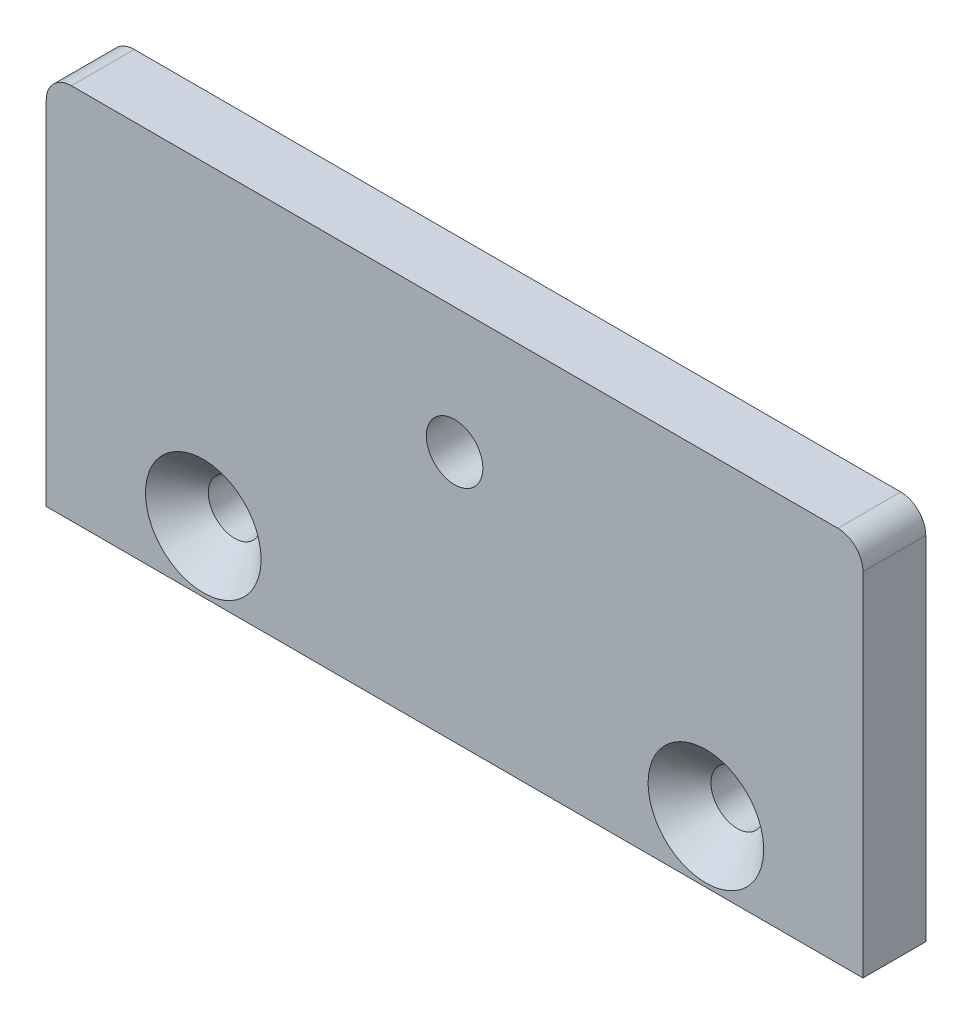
from build123d import *

# Parameters (mm, degrees)
ESQUISSE1_W        = 130
ESQUISSE1_H        = 60
ESQUISSE1_R        = 4.5
ESQUISSE1_R_2      = 4.2
BOSS_EXTRU_1_DEPTH = 10
CHANFREIN1_SIZE    = 5
CONG_1_R           = 4


with BuildPart() as part:
    # Esquisse1 → Boss.-Extru.1 (new body)
    with BuildSketch(Plane.XY):
        with Locations((65, 30)):
            Rectangle(ESQUISSE1_W, ESQUISSE1_H)
        with Locations((65, 40)):
            Circle(ESQUISSE1_R, mode=Mode.SUBTRACT)
        with Locations((25, 9.8)):
            Circle(ESQUISSE1_R_2, mode=Mode.SUBTRACT)
        with Locations((105, 9.8)):
            Circle(ESQUISSE1_R_2, mode=Mode.SUBTRACT)
    extrude(amount=BOSS_EXTRU_1_DEPTH)

    # Chanfrein1
    chanfrein1_edges = [part.edges().sort_by_distance(p)[0] for p in [
        (20.8, 9.8, 10),
        (100.8, 9.8, 10),
    ]]
    chamfer(chanfrein1_edges, length=CHANFREIN1_SIZE)

    # Cong_1
    cong_1_edges = [part.edges().sort_by_distance(p)[0] for p in [
        (0, 60, 5),
        (130, 60, 5),
    ]]
    fillet(cong_1_edges, radius=CONG_1_R)


solid = part.part
